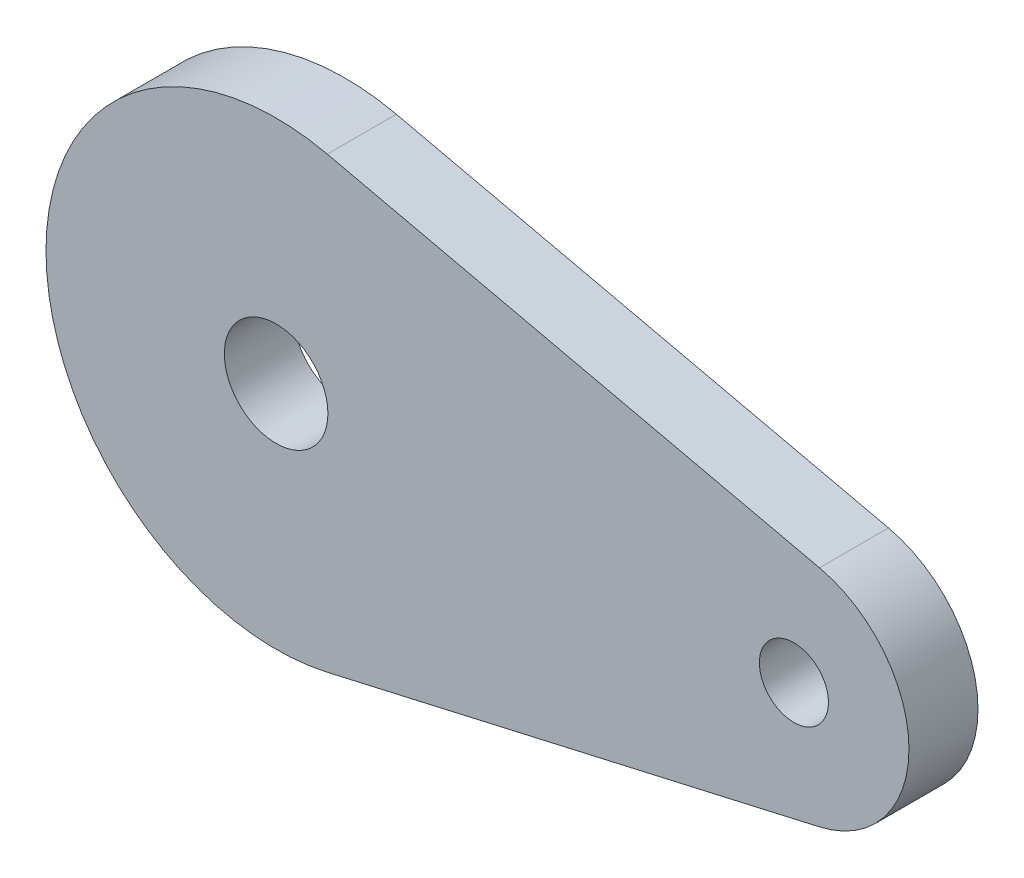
ISO-10303-21;
HEADER;
FILE_DESCRIPTION(('STEP AP214'),'2;1');
FILE_NAME('part.step','',(''),(''),'','','');
FILE_SCHEMA(('AUTOMOTIVE_DESIGN { 1 0 10303 214 1 1 1 1 }'));
ENDSEC;
DATA;
#1=APPLICATION_CONTEXT('core data for automotive mechanical design processes');
#2=APPLICATION_PROTOCOL_DEFINITION('international standard','automotive_design',2000,#1);
#3=PRODUCT_CONTEXT('',#1,'mechanical');
#4=PRODUCT('Part','Part','',(#3));
#5=PRODUCT_RELATED_PRODUCT_CATEGORY('part','',(#4));
#6=PRODUCT_DEFINITION_FORMATION('','',#4);
#7=PRODUCT_DEFINITION_CONTEXT('part definition',#1,'design');
#8=PRODUCT_DEFINITION('design','',#6,#7);
#9=PRODUCT_DEFINITION_SHAPE('','',#8);
#10=(LENGTH_UNIT() NAMED_UNIT(*) SI_UNIT(.MILLI.,.METRE.));
#11=(NAMED_UNIT(*) PLANE_ANGLE_UNIT() SI_UNIT($,.RADIAN.));
#12=(NAMED_UNIT(*) SI_UNIT($,.STERADIAN.) SOLID_ANGLE_UNIT());
#13=UNCERTAINTY_MEASURE_WITH_UNIT(LENGTH_MEASURE(1.E-05),#10,'distance_accuracy_value','');
#14=(GEOMETRIC_REPRESENTATION_CONTEXT(3) GLOBAL_UNCERTAINTY_ASSIGNED_CONTEXT((#13)) GLOBAL_UNIT_ASSIGNED_CONTEXT((#10,
#11,#12)) REPRESENTATION_CONTEXT('',''));
#15=CARTESIAN_POINT('',(0.,0.,0.));
#16=DIRECTION('',(0.,0.,1.));
#17=DIRECTION('',(1.,0.,0.));
#18=AXIS2_PLACEMENT_3D('',#15,#16,#17);
#19=CARTESIAN_POINT('',(0.,0.,12.));
#20=DIRECTION('',(0.,0.,1.));
#21=DIRECTION('',(1.,0.,0.));
#22=AXIS2_PLACEMENT_3D('',#19,#20,#21);
#23=PLANE('',#22);
#24=CARTESIAN_POINT('',(0.,0.,12.));
#25=DIRECTION('',(0.,0.,1.));
#26=DIRECTION('',(1.,0.,0.));
#27=AXIS2_PLACEMENT_3D('',#24,#25,#26);
#28=CIRCLE('',#27,9.);
#29=CARTESIAN_POINT('',(9.,0.,12.));
#30=VERTEX_POINT('',#29);
#31=EDGE_CURVE('E103',#30,#30,#28,.T.);
#32=ORIENTED_EDGE('',*,*,#31,.F.);
#33=EDGE_LOOP('',(#32));
#34=FACE_BOUND('',#33,.T.);
#35=CARTESIAN_POINT('',(0.,0.,12.));
#36=DIRECTION('',(0.,0.,1.));
#37=DIRECTION('',(1.,0.,0.));
#38=AXIS2_PLACEMENT_3D('',#35,#36,#37);
#39=CIRCLE('',#38,40.);
#40=CARTESIAN_POINT('',(8.88888888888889,38.9998417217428,12.));
#41=VERTEX_POINT('',#40);
#42=CARTESIAN_POINT('',(8.88888888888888,-38.9998417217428,12.));
#43=VERTEX_POINT('',#42);
#44=EDGE_CURVE('E88',#41,#43,#39,.T.);
#45=ORIENTED_EDGE('',*,*,#44,.T.);
#46=DIRECTION('',(0.974996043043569,0.222222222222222,0.));
#47=VECTOR('',#46,1.);
#48=CARTESIAN_POINT('',(8.88888888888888,-38.9998417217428,12.));
#49=LINE('',#48,#47);
#50=CARTESIAN_POINT('',(94.4444444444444,-19.4999208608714,12.));
#51=VERTEX_POINT('',#50);
#52=EDGE_CURVE('E83',#43,#51,#49,.T.);
#53=ORIENTED_EDGE('',*,*,#52,.T.);
#54=CARTESIAN_POINT('',(90.,0.,12.));
#55=DIRECTION('',(0.,0.,1.));
#56=DIRECTION('',(1.,0.,0.));
#57=AXIS2_PLACEMENT_3D('',#54,#55,#56);
#58=CIRCLE('',#57,20.);
#59=CARTESIAN_POINT('',(94.4444444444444,19.4999208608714,12.));
#60=VERTEX_POINT('',#59);
#61=EDGE_CURVE('E86',#51,#60,#58,.T.);
#62=ORIENTED_EDGE('',*,*,#61,.T.);
#63=DIRECTION('',(-0.974996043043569,0.222222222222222,0.));
#64=VECTOR('',#63,1.);
#65=CARTESIAN_POINT('',(8.88888888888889,38.9998417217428,12.));
#66=LINE('',#65,#64);
#67=EDGE_CURVE('E53',#60,#41,#66,.T.);
#68=ORIENTED_EDGE('',*,*,#67,.T.);
#69=EDGE_LOOP('',(#45,#53,#62,#68));
#70=FACE_BOUND('',#69,.T.);
#71=CARTESIAN_POINT('',(90.,0.,12.));
#72=DIRECTION('',(0.,0.,1.));
#73=DIRECTION('',(1.,0.,0.));
#74=AXIS2_PLACEMENT_3D('',#71,#72,#73);
#75=CIRCLE('',#74,6.);
#76=CARTESIAN_POINT('',(96.,0.,12.));
#77=VERTEX_POINT('',#76);
#78=EDGE_CURVE('E118',#77,#77,#75,.T.);
#79=ORIENTED_EDGE('',*,*,#78,.F.);
#80=EDGE_LOOP('',(#79));
#81=FACE_BOUND('',#80,.T.);
#82=ADVANCED_FACE('F36',(#34,#70,#81),#23,.T.);
#83=CARTESIAN_POINT('',(0.,0.,0.));
#84=DIRECTION('',(0.,0.,1.));
#85=DIRECTION('',(1.,0.,0.));
#86=AXIS2_PLACEMENT_3D('',#83,#84,#85);
#87=PLANE('',#86);
#88=CARTESIAN_POINT('',(0.,0.,0.));
#89=DIRECTION('',(0.,0.,1.));
#90=DIRECTION('',(1.,0.,0.));
#91=AXIS2_PLACEMENT_3D('',#88,#89,#90);
#92=CIRCLE('',#91,40.);
#93=CARTESIAN_POINT('',(8.88888888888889,38.9998417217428,0.));
#94=VERTEX_POINT('',#93);
#95=CARTESIAN_POINT('',(8.88888888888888,-38.9998417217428,0.));
#96=VERTEX_POINT('',#95);
#97=EDGE_CURVE('E100',#94,#96,#92,.T.);
#98=ORIENTED_EDGE('',*,*,#97,.F.);
#99=DIRECTION('',(-0.974996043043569,0.222222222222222,0.));
#100=VECTOR('',#99,1.);
#101=CARTESIAN_POINT('',(8.88888888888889,38.9998417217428,0.));
#102=LINE('',#101,#100);
#103=CARTESIAN_POINT('',(94.4444444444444,19.4999208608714,0.));
#104=VERTEX_POINT('',#103);
#105=EDGE_CURVE('E76',#104,#94,#102,.T.);
#106=ORIENTED_EDGE('',*,*,#105,.F.);
#107=CARTESIAN_POINT('',(90.,0.,0.));
#108=DIRECTION('',(0.,0.,1.));
#109=DIRECTION('',(1.,0.,0.));
#110=AXIS2_PLACEMENT_3D('',#107,#108,#109);
#111=CIRCLE('',#110,20.);
#112=CARTESIAN_POINT('',(94.4444444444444,-19.4999208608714,0.));
#113=VERTEX_POINT('',#112);
#114=EDGE_CURVE('E70',#113,#104,#111,.T.);
#115=ORIENTED_EDGE('',*,*,#114,.F.);
#116=DIRECTION('',(0.974996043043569,0.222222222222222,0.));
#117=VECTOR('',#116,1.);
#118=CARTESIAN_POINT('',(8.88888888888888,-38.9998417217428,0.));
#119=LINE('',#118,#117);
#120=EDGE_CURVE('E92',#96,#113,#119,.T.);
#121=ORIENTED_EDGE('',*,*,#120,.F.);
#122=EDGE_LOOP('',(#98,#106,#115,#121));
#123=FACE_BOUND('',#122,.T.);
#124=CARTESIAN_POINT('',(0.,0.,0.));
#125=DIRECTION('',(0.,0.,1.));
#126=DIRECTION('',(1.,0.,0.));
#127=AXIS2_PLACEMENT_3D('',#124,#125,#126);
#128=CIRCLE('',#127,9.);
#129=CARTESIAN_POINT('',(9.,0.,0.));
#130=VERTEX_POINT('',#129);
#131=EDGE_CURVE('E115',#130,#130,#128,.T.);
#132=ORIENTED_EDGE('',*,*,#131,.T.);
#133=EDGE_LOOP('',(#132));
#134=FACE_BOUND('',#133,.T.);
#135=CARTESIAN_POINT('',(90.,0.,0.));
#136=DIRECTION('',(0.,0.,1.));
#137=DIRECTION('',(1.,0.,0.));
#138=AXIS2_PLACEMENT_3D('',#135,#136,#137);
#139=CIRCLE('',#138,6.);
#140=CARTESIAN_POINT('',(96.,0.,0.));
#141=VERTEX_POINT('',#140);
#142=EDGE_CURVE('E121',#141,#141,#139,.T.);
#143=ORIENTED_EDGE('',*,*,#142,.T.);
#144=EDGE_LOOP('',(#143));
#145=FACE_BOUND('',#144,.T.);
#146=ADVANCED_FACE('F111',(#123,#134,#145),#87,.F.);
#147=CARTESIAN_POINT('',(0.,0.,12.));
#148=DIRECTION('',(0.,0.,-1.));
#149=DIRECTION('',(-1.,0.,0.));
#150=AXIS2_PLACEMENT_3D('',#147,#148,#149);
#151=CYLINDRICAL_SURFACE('',#150,40.);
#152=ORIENTED_EDGE('',*,*,#97,.T.);
#153=DIRECTION('',(0.,0.,-1.));
#154=VECTOR('',#153,1.);
#155=CARTESIAN_POINT('',(8.88888888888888,-38.9998417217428,12.));
#156=LINE('',#155,#154);
#157=EDGE_CURVE('E11',#43,#96,#156,.T.);
#158=ORIENTED_EDGE('',*,*,#157,.F.);
#159=ORIENTED_EDGE('',*,*,#44,.F.);
#160=DIRECTION('',(0.,0.,-1.));
#161=VECTOR('',#160,1.);
#162=CARTESIAN_POINT('',(8.88888888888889,38.9998417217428,12.));
#163=LINE('',#162,#161);
#164=EDGE_CURVE('E96',#41,#94,#163,.T.);
#165=ORIENTED_EDGE('',*,*,#164,.T.);
#166=EDGE_LOOP('',(#152,#158,#159,#165));
#167=FACE_BOUND('',#166,.T.);
#168=ADVANCED_FACE('F38',(#167),#151,.T.);
#169=CARTESIAN_POINT('',(8.88888888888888,-38.9998417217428,12.));
#170=DIRECTION('',(-0.222222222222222,0.974996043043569,0.));
#171=DIRECTION('',(-0.974996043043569,-0.222222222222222,0.));
#172=AXIS2_PLACEMENT_3D('',#169,#170,#171);
#173=PLANE('',#172);
#174=ORIENTED_EDGE('',*,*,#120,.T.);
#175=DIRECTION('',(0.,0.,-1.));
#176=VECTOR('',#175,1.);
#177=CARTESIAN_POINT('',(94.4444444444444,-19.4999208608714,12.));
#178=LINE('',#177,#176);
#179=EDGE_CURVE('E45',#51,#113,#178,.T.);
#180=ORIENTED_EDGE('',*,*,#179,.F.);
#181=ORIENTED_EDGE('',*,*,#52,.F.);
#182=ORIENTED_EDGE('',*,*,#157,.T.);
#183=EDGE_LOOP('',(#174,#180,#181,#182));
#184=FACE_BOUND('',#183,.T.);
#185=ADVANCED_FACE('F91',(#184),#173,.F.);
#186=CARTESIAN_POINT('',(90.,0.,12.));
#187=DIRECTION('',(0.,0.,-1.));
#188=DIRECTION('',(-1.,0.,0.));
#189=AXIS2_PLACEMENT_3D('',#186,#187,#188);
#190=CYLINDRICAL_SURFACE('',#189,20.);
#191=ORIENTED_EDGE('',*,*,#114,.T.);
#192=DIRECTION('',(0.,0.,-1.));
#193=VECTOR('',#192,1.);
#194=CARTESIAN_POINT('',(94.4444444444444,19.4999208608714,12.));
#195=LINE('',#194,#193);
#196=EDGE_CURVE('E93',#60,#104,#195,.T.);
#197=ORIENTED_EDGE('',*,*,#196,.F.);
#198=ORIENTED_EDGE('',*,*,#61,.F.);
#199=ORIENTED_EDGE('',*,*,#179,.T.);
#200=EDGE_LOOP('',(#191,#197,#198,#199));
#201=FACE_BOUND('',#200,.T.);
#202=ADVANCED_FACE('F94',(#201),#190,.T.);
#203=CARTESIAN_POINT('',(8.88888888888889,38.9998417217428,12.));
#204=DIRECTION('',(-0.222222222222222,-0.974996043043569,0.));
#205=DIRECTION('',(0.974996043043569,-0.222222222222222,0.));
#206=AXIS2_PLACEMENT_3D('',#203,#204,#205);
#207=PLANE('',#206);
#208=ORIENTED_EDGE('',*,*,#105,.T.);
#209=ORIENTED_EDGE('',*,*,#164,.F.);
#210=ORIENTED_EDGE('',*,*,#67,.F.);
#211=ORIENTED_EDGE('',*,*,#196,.T.);
#212=EDGE_LOOP('',(#208,#209,#210,#211));
#213=FACE_BOUND('',#212,.T.);
#214=ADVANCED_FACE('F108',(#213),#207,.F.);
#215=CARTESIAN_POINT('',(0.,0.,12.));
#216=DIRECTION('',(0.,0.,-1.));
#217=DIRECTION('',(-1.,0.,0.));
#218=AXIS2_PLACEMENT_3D('',#215,#216,#217);
#219=CYLINDRICAL_SURFACE('',#218,9.);
#220=ORIENTED_EDGE('',*,*,#31,.T.);
#221=EDGE_LOOP('',(#220));
#222=FACE_BOUND('',#221,.T.);
#223=ORIENTED_EDGE('',*,*,#131,.F.);
#224=EDGE_LOOP('',(#223));
#225=FACE_BOUND('',#224,.T.);
#226=ADVANCED_FACE('F138',(#222,#225),#219,.F.);
#227=CARTESIAN_POINT('',(90.,0.,12.));
#228=DIRECTION('',(0.,0.,-1.));
#229=DIRECTION('',(-1.,0.,0.));
#230=AXIS2_PLACEMENT_3D('',#227,#228,#229);
#231=CYLINDRICAL_SURFACE('',#230,6.);
#232=ORIENTED_EDGE('',*,*,#78,.T.);
#233=EDGE_LOOP('',(#232));
#234=FACE_BOUND('',#233,.T.);
#235=ORIENTED_EDGE('',*,*,#142,.F.);
#236=EDGE_LOOP('',(#235));
#237=FACE_BOUND('',#236,.T.);
#238=ADVANCED_FACE('F127',(#234,#237),#231,.F.);
#239=CLOSED_SHELL('',(#82,#146,#168,#185,#202,#214,#226,#238));
#240=MANIFOLD_SOLID_BREP('B2',#239);
#241=ADVANCED_BREP_SHAPE_REPRESENTATION('',(#18,#240),#14);
#242=SHAPE_DEFINITION_REPRESENTATION(#9,#241);
ENDSEC;
END-ISO-10303-21;
